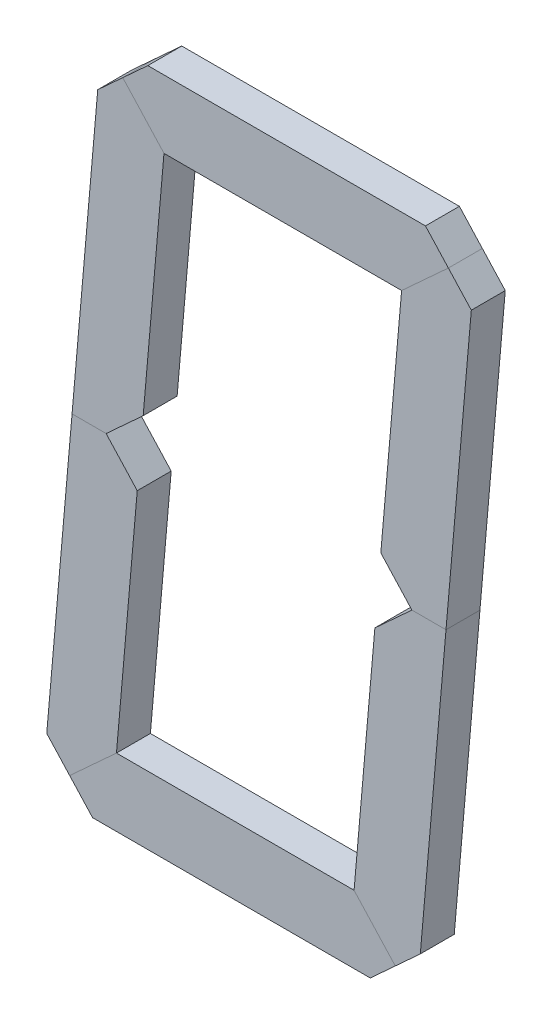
from build123d import *

# Parameters (mm, degrees)
AUFSATZ_LIN_UN_START    = -0.5
AUFSATZ_LIN_UN_DEPTH    = 0.5
AUFSATZ_LIN_LI_START    = -0.5
AUFSATZ_LIN_LI_UN_DEPTH = 0.5
AUFSATZ_LIN_RE_START    = -0.5
AUFSATZ_LIN_RE_UN_DEPTH = 0.5
AUFSATZ_LIN_MI_START    = -0.5
AUFSATZ_LIN_MI_DEPTH    = 0.5
KREISMUSTER_OB_COUNT    = 2


with BuildPart() as part:
    # Un → Aufsatz-Lin_Un (new body)
    with BuildSketch(Plane.XY.offset(AUFSATZ_LIN_UN_START)):
        Polygon((-2.451169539, -5), (1.638205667, -5), (2.006844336, -4.662204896), (1.400045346, -4), (-2.099954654, -4), (-2.788964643, -4.631361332), align=None)
    extrude(amount=AUFSATZ_LIN_UN_DEPTH)


with BuildPart() as body_2:
    # Li un → Aufsatz-Lin_Li un (new body)
    with BuildSketch(Plane.XY.offset(AUFSATZ_LIN_LI_START)):
        Polygon((-3.126759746, -4.262722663), (-2.753819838, 0), (-2.251909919, 0), (-1.793744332, -0.5), (-2.099954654, -4), (-2.788964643, -4.631361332), align=None)
    extrude(amount=AUFSATZ_LIN_LI_UN_DEPTH)


with BuildPart() as body_3:
    # Re un → Aufsatz-Lin_Re un (new body)
    with BuildSketch(Plane.XY.offset(AUFSATZ_LIN_RE_START)):
        Polygon((1.400045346, -4), (1.706255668, -0.5), (2.251909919, 0), (2.753819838, 0), (2.375483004, -4.324409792), (2.006844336, -4.662204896), align=None)
    extrude(amount=AUFSATZ_LIN_RE_UN_DEPTH)


with BuildPart() as body_4:
    # Mi → Aufsatz-Lin_Mi (new body)
    with BuildSketch(Plane.XY.offset(AUFSATZ_LIN_MI_START)):
        Polygon((-1.793744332, -0.5), (1.706255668, -0.5), (2.251909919, 0), (1.793744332, 0.5), (-1.706255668, 0.5), (-2.251909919, 0), align=None)
    extrude(amount=AUFSATZ_LIN_MI_DEPTH)


with BuildPart() as kreismuster_ob_1:
    # Kreismuster_Ob: pattern copy
    add(body_3.part.rotate(Axis((0, 0, 0), (0, 0, 1)), 1 * 360 / KREISMUSTER_OB_COUNT))


with BuildPart() as kreismuster_ob_2:
    # Kreismuster_Ob: pattern copy
    add(body_2.part.rotate(Axis((0, 0, 0), (0, 0, 1)), 1 * 360 / KREISMUSTER_OB_COUNT))


with BuildPart() as kreismuster_ob_3:
    # Kreismuster_Ob: pattern copy
    add(part.part.rotate(Axis((0, 0, 0), (0, 0, 1)), 1 * 360 / KREISMUSTER_OB_COUNT))


solid = Compound([part.part, body_2.part, body_3.part, kreismuster_ob_1.part, kreismuster_ob_2.part, kreismuster_ob_3.part])
